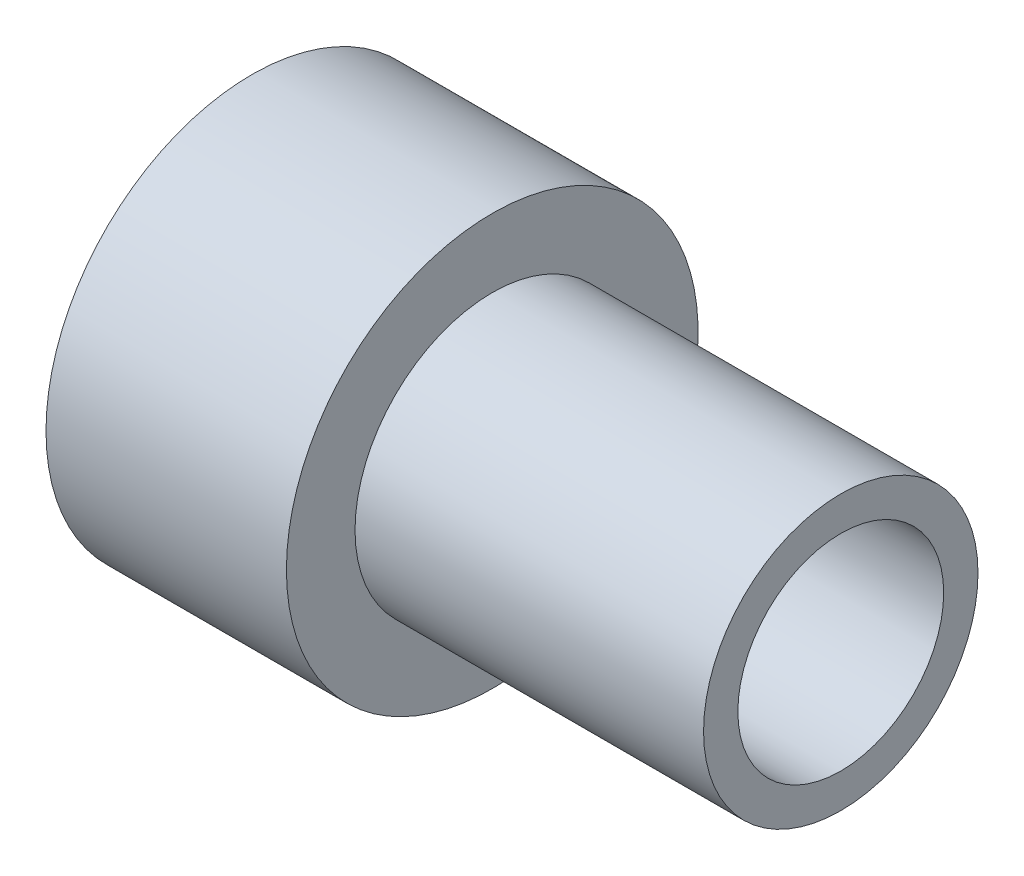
ISO-10303-21;
HEADER;
FILE_DESCRIPTION(('STEP AP214'),'2;1');
FILE_NAME('part.step','',(''),(''),'','','');
FILE_SCHEMA(('AUTOMOTIVE_DESIGN { 1 0 10303 214 1 1 1 1 }'));
ENDSEC;
DATA;
#1=APPLICATION_CONTEXT('core data for automotive mechanical design processes');
#2=APPLICATION_PROTOCOL_DEFINITION('international standard','automotive_design',2000,#1);
#3=PRODUCT_CONTEXT('',#1,'mechanical');
#4=PRODUCT('Part','Part','',(#3));
#5=PRODUCT_RELATED_PRODUCT_CATEGORY('part','',(#4));
#6=PRODUCT_DEFINITION_FORMATION('','',#4);
#7=PRODUCT_DEFINITION_CONTEXT('part definition',#1,'design');
#8=PRODUCT_DEFINITION('design','',#6,#7);
#9=PRODUCT_DEFINITION_SHAPE('','',#8);
#10=(LENGTH_UNIT() NAMED_UNIT(*) SI_UNIT(.MILLI.,.METRE.));
#11=(NAMED_UNIT(*) PLANE_ANGLE_UNIT() SI_UNIT($,.RADIAN.));
#12=(NAMED_UNIT(*) SI_UNIT($,.STERADIAN.) SOLID_ANGLE_UNIT());
#13=UNCERTAINTY_MEASURE_WITH_UNIT(LENGTH_MEASURE(1.E-05),#10,'distance_accuracy_value','');
#14=(GEOMETRIC_REPRESENTATION_CONTEXT(3) GLOBAL_UNCERTAINTY_ASSIGNED_CONTEXT((#13)) GLOBAL_UNIT_ASSIGNED_CONTEXT((#10,
#11,#12)) REPRESENTATION_CONTEXT('',''));
#15=CARTESIAN_POINT('',(0.,0.,0.));
#16=DIRECTION('',(0.,0.,1.));
#17=DIRECTION('',(1.,0.,0.));
#18=AXIS2_PLACEMENT_3D('',#15,#16,#17);
#19=CARTESIAN_POINT('',(0.,9.525,0.));
#20=DIRECTION('',(1.,0.,0.));
#21=DIRECTION('',(0.,0.,-1.));
#22=AXIS2_PLACEMENT_3D('',#19,#20,#21);
#23=PLANE('',#22);
#24=CARTESIAN_POINT('',(0.,0.,0.));
#25=DIRECTION('',(-1.,0.,0.));
#26=DIRECTION('',(0.,0.,1.));
#27=AXIS2_PLACEMENT_3D('',#24,#25,#26);
#28=CIRCLE('',#27,4.7625);
#29=CARTESIAN_POINT('',(0.,0.,4.7625));
#30=VERTEX_POINT('',#29);
#31=EDGE_CURVE('E10',#30,#30,#28,.T.);
#32=ORIENTED_EDGE('',*,*,#31,.F.);
#33=EDGE_LOOP('',(#32));
#34=FACE_BOUND('',#33,.T.);
#35=CARTESIAN_POINT('',(0.,0.,0.));
#36=DIRECTION('',(-1.,0.,0.));
#37=DIRECTION('',(0.,0.,1.));
#38=AXIS2_PLACEMENT_3D('',#35,#36,#37);
#39=CIRCLE('',#38,9.525);
#40=CARTESIAN_POINT('',(0.,0.,9.525));
#41=VERTEX_POINT('',#40);
#42=EDGE_CURVE('E53',#41,#41,#39,.T.);
#43=ORIENTED_EDGE('',*,*,#42,.T.);
#44=EDGE_LOOP('',(#43));
#45=FACE_BOUND('',#44,.T.);
#46=ADVANCED_FACE('F31',(#34,#45),#23,.F.);
#47=CARTESIAN_POINT('',(0.,0.,0.));
#48=DIRECTION('',(-1.,0.,0.));
#49=DIRECTION('',(0.,0.,1.));
#50=AXIS2_PLACEMENT_3D('',#47,#48,#49);
#51=CYLINDRICAL_SURFACE('',#50,4.7625);
#52=CARTESIAN_POINT('',(27.2542,0.,0.));
#53=DIRECTION('',(-1.,0.,0.));
#54=DIRECTION('',(0.,0.,1.));
#55=AXIS2_PLACEMENT_3D('',#52,#53,#54);
#56=CIRCLE('',#55,4.7625);
#57=CARTESIAN_POINT('',(27.2542,0.,4.7625));
#58=VERTEX_POINT('',#57);
#59=EDGE_CURVE('E37',#58,#58,#56,.T.);
#60=ORIENTED_EDGE('',*,*,#59,.F.);
#61=EDGE_LOOP('',(#60));
#62=FACE_BOUND('',#61,.T.);
#63=ORIENTED_EDGE('',*,*,#31,.T.);
#64=EDGE_LOOP('',(#63));
#65=FACE_BOUND('',#64,.T.);
#66=ADVANCED_FACE('F78',(#62,#65),#51,.F.);
#67=CARTESIAN_POINT('',(27.2542,4.7625,0.));
#68=DIRECTION('',(-1.,0.,0.));
#69=DIRECTION('',(0.,0.,1.));
#70=AXIS2_PLACEMENT_3D('',#67,#68,#69);
#71=PLANE('',#70);
#72=CARTESIAN_POINT('',(27.2542,0.,0.));
#73=DIRECTION('',(-1.,0.,0.));
#74=DIRECTION('',(0.,0.,1.));
#75=AXIS2_PLACEMENT_3D('',#72,#73,#74);
#76=CIRCLE('',#75,6.35);
#77=CARTESIAN_POINT('',(27.2542,0.,6.35));
#78=VERTEX_POINT('',#77);
#79=EDGE_CURVE('E41',#78,#78,#76,.T.);
#80=ORIENTED_EDGE('',*,*,#79,.F.);
#81=EDGE_LOOP('',(#80));
#82=FACE_BOUND('',#81,.T.);
#83=ORIENTED_EDGE('',*,*,#59,.T.);
#84=EDGE_LOOP('',(#83));
#85=FACE_BOUND('',#84,.T.);
#86=ADVANCED_FACE('F73',(#82,#85),#71,.F.);
#87=CARTESIAN_POINT('',(0.,0.,0.));
#88=DIRECTION('',(-1.,0.,0.));
#89=DIRECTION('',(0.,0.,1.));
#90=AXIS2_PLACEMENT_3D('',#87,#88,#89);
#91=CYLINDRICAL_SURFACE('',#90,6.35);
#92=CARTESIAN_POINT('',(11.1252,0.,0.));
#93=DIRECTION('',(-1.,0.,0.));
#94=DIRECTION('',(0.,0.,1.));
#95=AXIS2_PLACEMENT_3D('',#92,#93,#94);
#96=CIRCLE('',#95,6.35);
#97=CARTESIAN_POINT('',(11.1252,0.,6.35));
#98=VERTEX_POINT('',#97);
#99=EDGE_CURVE('E45',#98,#98,#96,.T.);
#100=ORIENTED_EDGE('',*,*,#99,.F.);
#101=EDGE_LOOP('',(#100));
#102=FACE_BOUND('',#101,.T.);
#103=ORIENTED_EDGE('',*,*,#79,.T.);
#104=EDGE_LOOP('',(#103));
#105=FACE_BOUND('',#104,.T.);
#106=ADVANCED_FACE('F67',(#102,#105),#91,.T.);
#107=CARTESIAN_POINT('',(11.1252,6.35,0.));
#108=DIRECTION('',(-1.,0.,0.));
#109=DIRECTION('',(0.,0.,1.));
#110=AXIS2_PLACEMENT_3D('',#107,#108,#109);
#111=PLANE('',#110);
#112=CARTESIAN_POINT('',(11.1252,0.,0.));
#113=DIRECTION('',(-1.,0.,0.));
#114=DIRECTION('',(0.,0.,1.));
#115=AXIS2_PLACEMENT_3D('',#112,#113,#114);
#116=CIRCLE('',#115,9.525);
#117=CARTESIAN_POINT('',(11.1252,0.,9.525));
#118=VERTEX_POINT('',#117);
#119=EDGE_CURVE('E50',#118,#118,#116,.T.);
#120=ORIENTED_EDGE('',*,*,#119,.F.);
#121=EDGE_LOOP('',(#120));
#122=FACE_BOUND('',#121,.T.);
#123=ORIENTED_EDGE('',*,*,#99,.T.);
#124=EDGE_LOOP('',(#123));
#125=FACE_BOUND('',#124,.T.);
#126=ADVANCED_FACE('F61',(#122,#125),#111,.F.);
#127=CARTESIAN_POINT('',(0.,0.,0.));
#128=DIRECTION('',(-1.,0.,0.));
#129=DIRECTION('',(0.,0.,1.));
#130=AXIS2_PLACEMENT_3D('',#127,#128,#129);
#131=CYLINDRICAL_SURFACE('',#130,9.525);
#132=ORIENTED_EDGE('',*,*,#42,.F.);
#133=EDGE_LOOP('',(#132));
#134=FACE_BOUND('',#133,.T.);
#135=ORIENTED_EDGE('',*,*,#119,.T.);
#136=EDGE_LOOP('',(#135));
#137=FACE_BOUND('',#136,.T.);
#138=ADVANCED_FACE('F58',(#134,#137),#131,.T.);
#139=CLOSED_SHELL('',(#46,#66,#86,#106,#126,#138));
#140=MANIFOLD_SOLID_BREP('B2',#139);
#141=ADVANCED_BREP_SHAPE_REPRESENTATION('',(#18,#140),#14);
#142=SHAPE_DEFINITION_REPRESENTATION(#9,#141);
ENDSEC;
END-ISO-10303-21;
